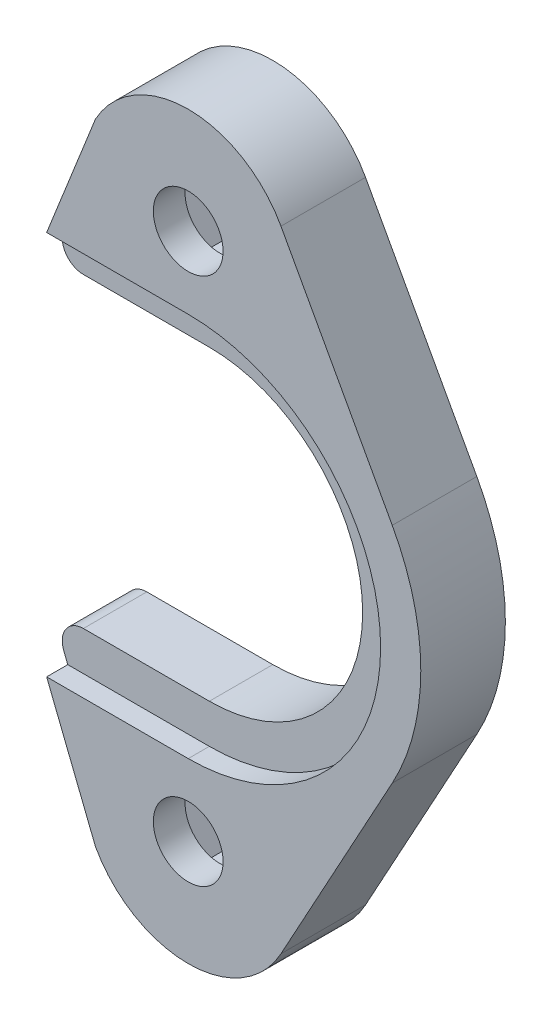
from build123d import *

# Parameters (mm, degrees)
SKETCH_1_R          = 1.65
EXTRUDE_1_DEPTH     = 4
CUT_EXTRUDE_1_DEPTH = 2.5
CUT_EXTRUDE_2_DEPTH = 1
FILLET_1_R          = 1


with BuildPart() as part:
    # Sketch 1 → Extrude 1 (new body)
    with BuildSketch(Plane.XY):
        with BuildLine():
            Line((9.649997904, 5.279918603), (4.386362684, 14.900155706))
            ThreePointArc((4.386362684, 14.900155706), (0, 17.500192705), (-4.386362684, 14.900155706))
            Line((-4.386362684, 14.900155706), (-7.432131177, 7.25))
            Line((-7.432131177, 7.25), (0, 7.25))
            ThreePointArc((0, 7.25), (7.25, 0), (0, -7.25))
            Line((0, -7.25), (-7.432131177, -7.25))
            Line((-7.432131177, -7.25), (-4.386362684, -14.900155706))
            ThreePointArc((-4.386362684, -14.900155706), (0, -17.500192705), (4.386362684, -14.900155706))
            Line((4.386362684, -14.900155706), (9.649997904, -5.279918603))
            ThreePointArc((9.649997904, -5.279918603), (11, 0), (9.649997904, 5.279918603))
        make_face()
        with Locations((0, -12.500192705)):
            Circle(SKETCH_1_R, mode=Mode.SUBTRACT)
        with Locations(Location((0, 12.500192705, 0), (0, 0, 180))):
            Circle(SKETCH_1_R, mode=Mode.SUBTRACT)
    extrude(amount=-EXTRUDE_1_DEPTH)

    # Sketch 2 → Cut-Extrude 1 (cut)
    with BuildSketch(Plane(origin=(0, 0, -4), x_dir=(-1, 0, 0), z_dir=(0, 0, -1))):
        Polygon((3.290896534, 12.500192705), (1.645448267, 15.350192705), (-1.645448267, 15.350192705), (-3.290896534, 12.500192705), (-1.645448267, 9.650192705), (1.645448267, 9.650192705), align=None)
        Polygon((1.645448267, -9.650192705), (3.290896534, -12.500192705), (1.645448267, -15.350192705), (-1.645448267, -15.350192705), (-3.290896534, -12.500192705), (-1.645448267, -9.650192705), align=None)
    extrude(amount=-CUT_EXTRUDE_1_DEPTH, mode=Mode.SUBTRACT)

    # Sketch 3 → Cut-Extrude 2 (cut)
    with BuildSketch(Plane.XY):
        with BuildLine():
            Line((0, 9.1), (-9.1, 9.1))
            Line((-9.1, 9.1), (-9.1, -9.1))
            Line((-9.1, -9.1), (0, -9.1))
            ThreePointArc((0, -9.1), (9.1, 0), (0, 9.1))
        make_face()
    extrude(amount=-CUT_EXTRUDE_2_DEPTH, mode=Mode.SUBTRACT)

    # Fillet 1
    fillet_1_edges = [part.edges().sort_by_distance(p)[0] for p in [
        (-7.432131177, -7.25, -2.5),
        (-7.432131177, 7.25, -2.5),
    ]]
    fillet(fillet_1_edges, radius=FILLET_1_R)


solid = part.part
